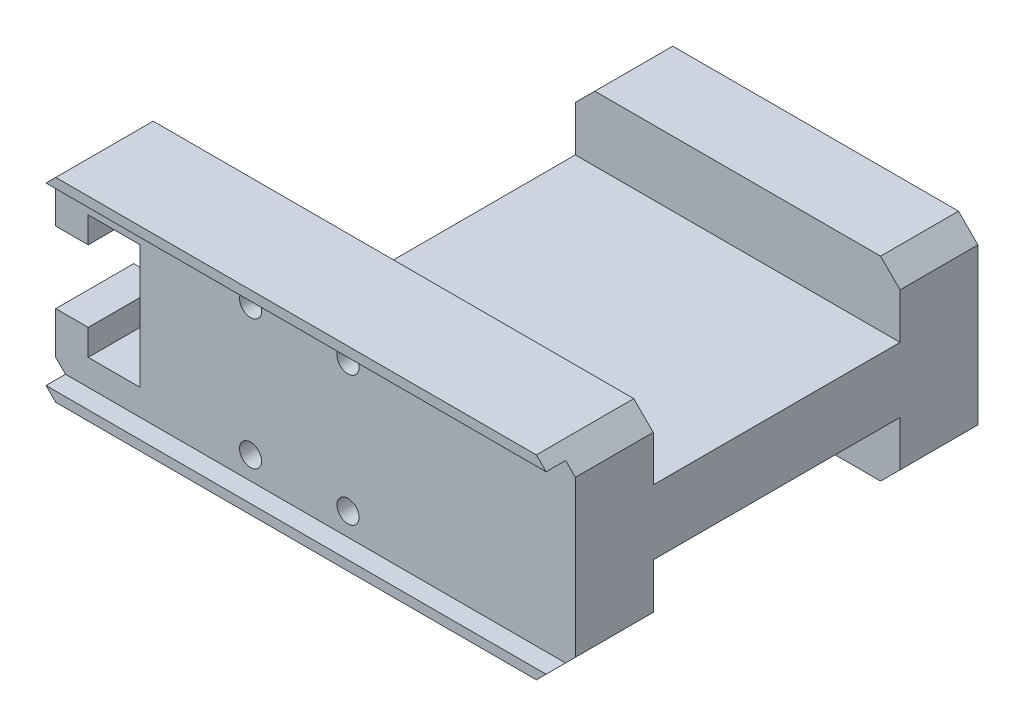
from build123d import *

# Parameters (mm, degrees)
SKETCH_1_W                  = 80
SKETCH_1_H                  = 30
EXTRUDE_1_DEPTH             = 32.5
SKETCH_2_W                  = 140.081802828
SKETCH_2_H                  = 27
CUT_EXTRUDE_1_DEPTH         = 3
HOLE_WIZARD_3_4_3_4_1_D     = 3.4
HOLE_WIZARD_3_4_3_4_1_DEPTH = 20
HOLE_WIZARD_3_4_3_4_1_TIP   = 1.021463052
SKETCH_5_W                  = 10
SKETCH_5_H                  = 11
CUT_EXTRUDE_2_DEPTH         = 78.781745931
SKETCH_6_W                  = 8
SKETCH_6_H                  = 19
CUT_EXTRUDE_3_DEPTH         = 78.781745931
HOLE_WIZARD_M5_2_D          = 4.2
HOLE_WIZARD_M5_2_DEPTH      = 20
HOLE_WIZARD_M5_2_TIP        = 1.2618073
SKETCH_13_W                 = 121.156367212
SKETCH_13_H                 = 38
CUT_EXTRUDE_4_DEPTH         = 10
CUT_EXTRUDE_5_REACH         = 82.889
SKETCH_14_W                 = 57.855656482
SKETCH_14_H                 = 68.267402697
CHAMFER_1_SIZE              = 3


with BuildPart() as part:
    # Sketch 1 → Extrude 1 (new, symmetric)
    with BuildSketch(Plane.XY):
        Rectangle(SKETCH_1_W, SKETCH_1_H)
    extrude(amount=EXTRUDE_1_DEPTH, both=True)

    # Sketch 2 → Cut-Extrude 1 (cut)
    with BuildSketch(Plane.XY.offset(32.5)):
        Rectangle(SKETCH_2_W, SKETCH_2_H)
    extrude(amount=-CUT_EXTRUDE_1_DEPTH, mode=Mode.SUBTRACT)

    # Hole Wizard 3.4 _3.4_ _1
    with Locations(Plane(origin=(30.14039619, -0.23160271, 29.5), x_dir=(-1, 0, 0), z_dir=(0, 0, 1))):
        with Locations((25.14039619, -10.23160271), (40.14039619, -10.23160271), (40.14039619, 9.76839729), (25.14039619, 9.76839729)):
            Hole(HOLE_WIZARD_3_4_3_4_1_D / 2, depth=HOLE_WIZARD_3_4_3_4_1_DEPTH)
            with Locations((0, 0, -(HOLE_WIZARD_3_4_3_4_1_DEPTH + HOLE_WIZARD_3_4_3_4_1_TIP / 2))):  # 118° drill point
                Cone(0, HOLE_WIZARD_3_4_3_4_1_D / 2, HOLE_WIZARD_3_4_3_4_1_TIP, mode=Mode.SUBTRACT)

    # Sketch 5 → Cut-Extrude 2 (cut, through all)
    with BuildSketch(Plane(origin=(0, 0, -32.5), x_dir=(-1, 0, 0), z_dir=(0, 0, -1))):
        with Locations((40, 0)):
            Rectangle(SKETCH_5_W, SKETCH_5_H)
    extrude(amount=-CUT_EXTRUDE_2_DEPTH, mode=Mode.SUBTRACT)

    # Sketch 6 → Cut-Extrude 3 (cut, through all)
    with BuildSketch(Plane(origin=(0, 0, -32.5), x_dir=(-1, 0, 0), z_dir=(0, 0, -1))):
        with Locations((31, 0)):
            Rectangle(SKETCH_6_W, SKETCH_6_H)
    extrude(amount=-CUT_EXTRUDE_3_DEPTH, mode=Mode.SUBTRACT)

    # Hole Wizard M5 _2
    with Locations(Plane(origin=(0, 0, -32.5), x_dir=(-1, 0, 0), z_dir=(0, 0, -1))):
        with Locations((-10, 0)):
            Hole(HOLE_WIZARD_M5_2_D / 2, depth=HOLE_WIZARD_M5_2_DEPTH)
            with Locations((0, 0, -(HOLE_WIZARD_M5_2_DEPTH + HOLE_WIZARD_M5_2_TIP / 2))):  # 118° drill point
                Cone(0, HOLE_WIZARD_M5_2_D / 2, HOLE_WIZARD_M5_2_TIP, mode=Mode.SUBTRACT)

    # Sketch 13 → Cut-Extrude 4 (cut)
    with BuildSketch(Plane.XZ.offset(15)):
        with Locations((8.720187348, -1.5)):
            Rectangle(SKETCH_13_W, SKETCH_13_H)
    cut_extrude_4 = extrude(amount=-CUT_EXTRUDE_4_DEPTH, mode=Mode.SUBTRACT)

    # Mirror 1: Cut-Extrude 4 across plane
    add(cut_extrude_4.mirror(Plane.ZX), mode=Mode.SUBTRACT)

    # Cut-Extrude 5: up to this face of the body (flat: up to its plane)
    cut_extrude_5_end = Plane(part.part.faces().sort_by_distance((1.688518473, 10.149157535, 17.5))[0])
    # Sketch 14 → Cut-Extrude 5 (cut, up to the picked face)
    with BuildSketch(Plane(origin=(-5.75, 0, -32.5), x_dir=(1, 0, 0), z_dir=(0, 0, 1)), mode=Mode.PRIVATE) as cut_extrude_5_sk1:
        with Locations((-33.177828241, 8.580571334)):
            Rectangle(SKETCH_14_W, SKETCH_14_H)
    cut_extrude_5_tool1 = split(extrude(cut_extrude_5_sk1.sketch, amount=CUT_EXTRUDE_5_REACH, mode=Mode.PRIVATE), bisect_by=cut_extrude_5_end, keep=Keep.BOTH, mode=Mode.PRIVATE)
    add(cut_extrude_5_tool1.solids().sort_by(Axis((-38.927828, 8.580571, -32.5), (0, 0, 1)))[0], mode=Mode.SUBTRACT)

    # Chamfer 1
    chamfer_1_edges = [part.edges().sort_by_distance(p)[0] for p in [
        (-40, 15, 25),
        (-40, -15, 25),
        (40, -15, 25),
        (40, -15, -26.5),
        (40, 15, 25),
        (40, 15, -26.5),
        (-10, 15, -26.5),
        (-10, -15, -26.5),
    ]]
    chamfer(chamfer_1_edges, length=CHAMFER_1_SIZE)


solid = part.part
